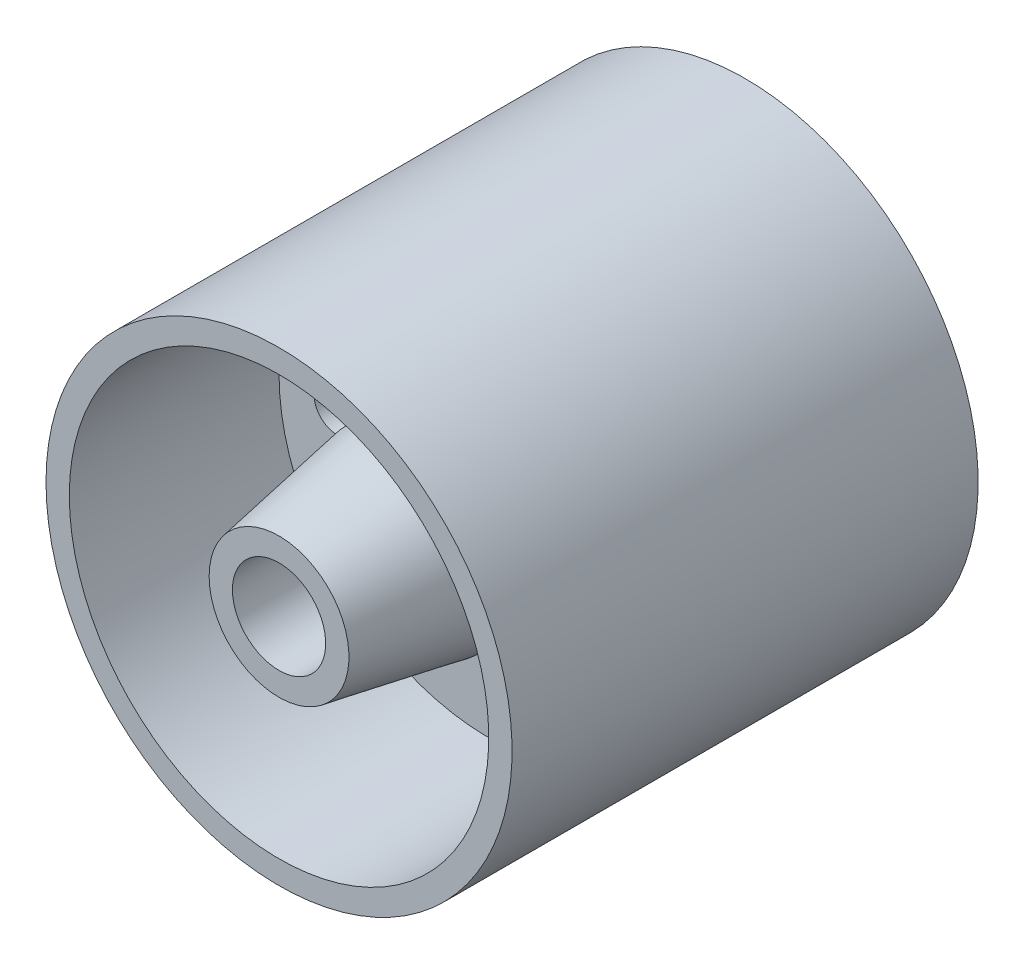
from build123d import *

# Parameters (mm, degrees)
F_10_0_10_DIAMETER_HOLE1_D = 10
CIRPATTERN1_COUNT          = 6


with BuildPart() as part:
    # Sketch1 → Revolve1 (revolve)
    with BuildSketch(Plane(origin=(0, 0, 0), x_dir=(0, 0, -1), z_dir=(1, 0, 0)), mode=Mode.PRIVATE) as revolve1_sk:
        Polygon((0, 10), (-50, 10), (-50, 15), (-21.643590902, 20), (-5, 20), (-5, 45), (-50, 45), (-50, 50), (0, 50), align=None)
    revolve(revolve1_sk.sketch.rotate(Axis((0, 0, 0), (0, 0, 1)), 90), axis=Axis((0, 0, 0), (0, 0, 1)))

    # Mirror1: part across plane


with BuildPart() as part_1:
    add(part.part)
    add(part.part.mirror(Plane(origin=(0, 50, 0), x_dir=(1, 0, 0), z_dir=(0, 0, -1))))

    # 10.0 _10_ Diameter Hole1 (through all)
    with Locations(Plane.XY.offset(5)):
        with Locations((32.5, 0)):
            f_10_0_10_diameter_hole1 = Hole(F_10_0_10_DIAMETER_HOLE1_D / 2)

    # CirPattern1: 10.0 _10_ Diameter Hole1 ×6 about axis
    cirpattern1_axis = Axis((0, 0, 0), (0, 0, 1))
    for i in range(1, CIRPATTERN1_COUNT):
        add(f_10_0_10_diameter_hole1.rotate(cirpattern1_axis, i * 360 / CIRPATTERN1_COUNT), mode=Mode.SUBTRACT)


solid = part_1.part
